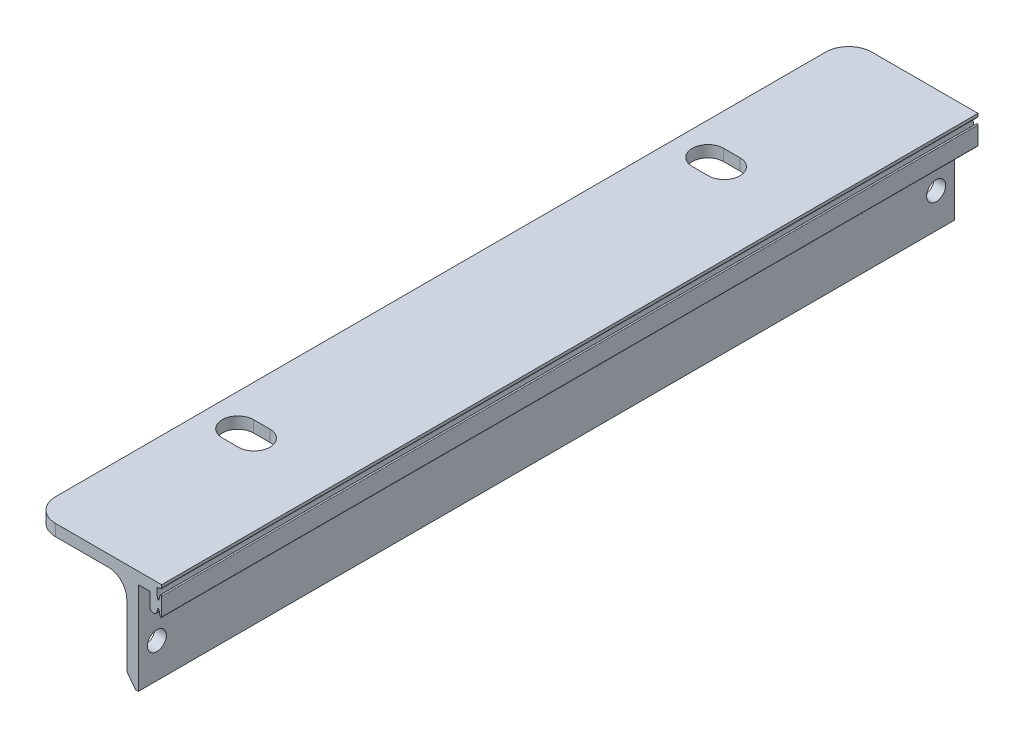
from build123d import *

# Parameters (mm, degrees)
EXTRUDE_1_DEPTH     = 88.225
CUT_EXTRUDE_1_DEPTH = 2360.681391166
SKETCH_3_R          = 2.05
CUT_EXTRUDE_2_DEPTH = 3314.841207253
FILLET_1_R          = 5
FILLET_2_R          = 4


with BuildPart() as part:
    # Sketch 1 → Extrude 1 (new, symmetric)
    with BuildSketch(Plane.XY):
        with BuildLine():
            Line((2329.984035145, -3290.103769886), (2357.924035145, -3290.103769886))
            Line((2357.924035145, -3290.103769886), (2357.924035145, -3290.678434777))
            ThreePointArc((2357.924035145, -3290.678434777), (2357.852490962, -3290.872877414), (2357.671982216, -3290.974578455))
            Line((2357.671982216, -3290.974578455), (2357.122903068, -3291.063476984))
            ThreePointArc((2357.122903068, -3291.063476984), (2356.946343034, -3291.16063182), (2356.871091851, -3291.347580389))
            ThreePointArc((2356.871091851, -3291.347580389), (2356.901089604, -3292.278950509), (2357.065058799, -3293.196264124))
            ThreePointArc((2357.065058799, -3293.196264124), (2357.205621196, -3293.328533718), (2357.360114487, -3293.212840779))
            Line((2357.360114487, -3293.212840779), (2357.58835224, -3292.234268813))
            ThreePointArc((2357.58835224, -3292.234268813), (2357.776780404, -3292.104309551), (2357.924035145, -3292.279554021))
            Line((2357.924035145, -3292.279554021), (2357.924035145, -3296.127985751))
            ThreePointArc((2357.924035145, -3296.127985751), (2357.774272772, -3296.303549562), (2357.587277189, -3296.168330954))
            Line((2357.587277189, -3296.168330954), (2357.361062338, -3295.049054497))
            ThreePointArc((2357.361062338, -3295.049054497), (2357.210519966, -3294.92881108), (2357.065777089, -3295.055976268))
            Line((2357.065777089, -3295.055976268), (2356.933150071, -3295.682639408))
            ThreePointArc((2356.933150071, -3295.682639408), (2356.085568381, -3296.299295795), (2355.384035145, -3295.520507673))
            Line((2355.384035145, -3295.520507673), (2355.384035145, -3292.603769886))
            Line((2355.384035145, -3292.603769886), (2352.884035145, -3292.603769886))
            Line((2352.884035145, -3292.603769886), (2352.884035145, -3312.603769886))
            Line((2352.884035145, -3312.603769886), (2352.284035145, -3312.603769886))
            Line((2352.284035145, -3312.603769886), (2350.384035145, -3310.103769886))
            Line((2350.384035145, -3310.103769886), (2350.384035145, -3292.603769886))
            Line((2350.384035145, -3292.603769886), (2329.984035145, -3292.603769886))
            Line((2329.984035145, -3292.603769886), (2329.984035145, -3290.103769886))
        make_face()
    extrude(amount=EXTRUDE_1_DEPTH, both=True)

    # Sketch 2 → Cut-Extrude 1 (cut, through all)
    with BuildSketch(Plane(origin=(0, -3290.103769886, 0), x_dir=(1, 0, 0), z_dir=(0, 1, 0))):
        with BuildLine():
            Line((2340.484035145, -47.4), (2336.984035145, -47.4))
            ThreePointArc((2336.984035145, -47.4), (2333.584035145, -50.8), (2336.984035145, -54.2))
            Line((2336.984035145, -54.2), (2340.484035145, -54.2))
            ThreePointArc((2340.484035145, -54.2), (2343.884035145, -50.8), (2340.484035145, -47.4))
        make_face()
        with BuildLine():
            Line((2340.484035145, 54.2), (2336.984035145, 54.2))
            ThreePointArc((2336.984035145, 54.2), (2333.584035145, 50.8), (2336.984035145, 47.4))
            Line((2336.984035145, 47.4), (2340.484035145, 47.4))
            ThreePointArc((2340.484035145, 47.4), (2343.884035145, 50.8), (2340.484035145, 54.2))
        make_face()
    extrude(amount=-CUT_EXTRUDE_1_DEPTH, mode=Mode.SUBTRACT)

    # Sketch 3 → Cut-Extrude 2 (cut, through all)
    with BuildSketch(Plane.ZY.offset(-2350.384035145)):
        with Locations(Location((-84.225, -3305.103769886, 0), (0, 0, 270))):
            Circle(SKETCH_3_R)
        with Locations(Location((84.225, -3305.103769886, 0), (0, 0, 270))):
            Circle(SKETCH_3_R)
        with Locations((-84.225, -3325.103769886)):
            Circle(SKETCH_3_R)
        with Locations((84.225, -3325.103769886)):
            Circle(SKETCH_3_R)
    extrude(amount=-CUT_EXTRUDE_2_DEPTH, mode=Mode.SUBTRACT)

    # Fillet 1
    fillet_1_edges = [part.edges().sort_by_distance(p)[0] for p in [
        (2329.984035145, -3291.353769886, -88.225),
        (2329.984035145, -3291.353769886, 88.225),
    ]]
    fillet(fillet_1_edges, radius=FILLET_1_R)

    # Fillet 2
    fillet_2_edges = [part.edges().sort_by_distance(p)[0] for p in [
        (2350.384035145, -3292.603769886, 0),
    ]]
    fillet(fillet_2_edges, radius=FILLET_2_R)


solid = part.part
